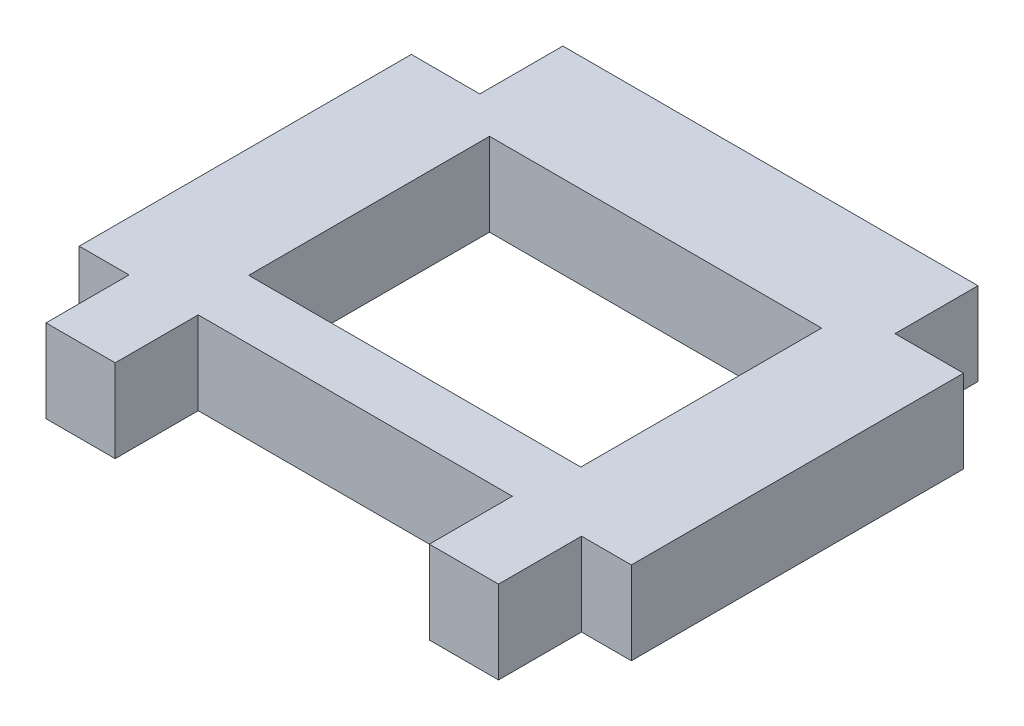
ISO-10303-21;
HEADER;
FILE_DESCRIPTION(('STEP AP214'),'2;1');
FILE_NAME('part.step','',(''),(''),'','','');
FILE_SCHEMA(('AUTOMOTIVE_DESIGN { 1 0 10303 214 1 1 1 1 }'));
ENDSEC;
DATA;
#1=APPLICATION_CONTEXT('core data for automotive mechanical design processes');
#2=APPLICATION_PROTOCOL_DEFINITION('international standard','automotive_design',2000,#1);
#3=PRODUCT_CONTEXT('',#1,'mechanical');
#4=PRODUCT('Part','Part','',(#3));
#5=PRODUCT_RELATED_PRODUCT_CATEGORY('part','',(#4));
#6=PRODUCT_DEFINITION_FORMATION('','',#4);
#7=PRODUCT_DEFINITION_CONTEXT('part definition',#1,'design');
#8=PRODUCT_DEFINITION('design','',#6,#7);
#9=PRODUCT_DEFINITION_SHAPE('','',#8);
#10=(LENGTH_UNIT() NAMED_UNIT(*) SI_UNIT(.MILLI.,.METRE.));
#11=(NAMED_UNIT(*) PLANE_ANGLE_UNIT() SI_UNIT($,.RADIAN.));
#12=(NAMED_UNIT(*) SI_UNIT($,.STERADIAN.) SOLID_ANGLE_UNIT());
#13=UNCERTAINTY_MEASURE_WITH_UNIT(LENGTH_MEASURE(1.E-05),#10,'distance_accuracy_value','');
#14=(GEOMETRIC_REPRESENTATION_CONTEXT(3) GLOBAL_UNCERTAINTY_ASSIGNED_CONTEXT((#13)) GLOBAL_UNIT_ASSIGNED_CONTEXT((#10,
#11,#12)) REPRESENTATION_CONTEXT('',''));
#15=CARTESIAN_POINT('',(0.,0.,0.));
#16=DIRECTION('',(0.,0.,1.));
#17=DIRECTION('',(1.,0.,0.));
#18=AXIS2_PLACEMENT_3D('',#15,#16,#17);
#19=CARTESIAN_POINT('',(0.,3.,0.));
#20=DIRECTION('',(0.,1.,0.));
#21=DIRECTION('',(0.,0.,1.));
#22=AXIS2_PLACEMENT_3D('',#19,#20,#21);
#23=PLANE('',#22);
#24=DIRECTION('',(0.,0.,1.));
#25=VECTOR('',#24,1.);
#26=CARTESIAN_POINT('',(12.,3.,-8.7));
#27=LINE('',#26,#25);
#28=CARTESIAN_POINT('',(12.,3.,8.7));
#29=VERTEX_POINT('',#28);
#30=CARTESIAN_POINT('',(12.,3.,-8.7));
#31=VERTEX_POINT('',#30);
#32=EDGE_CURVE('E286',#29,#31,#27,.F.);
#33=ORIENTED_EDGE('',*,*,#32,.F.);
#34=DIRECTION('',(-1.,0.,0.));
#35=VECTOR('',#34,1.);
#36=CARTESIAN_POINT('',(12.,3.,8.7));
#37=LINE('',#36,#35);
#38=CARTESIAN_POINT('',(-12.,3.,8.7));
#39=VERTEX_POINT('',#38);
#40=EDGE_CURVE('E268',#39,#29,#37,.F.);
#41=ORIENTED_EDGE('',*,*,#40,.F.);
#42=DIRECTION('',(0.,0.,-1.));
#43=VECTOR('',#42,1.);
#44=CARTESIAN_POINT('',(-12.,3.,8.7));
#45=LINE('',#44,#43);
#46=CARTESIAN_POINT('',(-12.,3.,-8.7));
#47=VERTEX_POINT('',#46);
#48=EDGE_CURVE('E271',#47,#39,#45,.F.);
#49=ORIENTED_EDGE('',*,*,#48,.F.);
#50=DIRECTION('',(1.,0.,0.));
#51=VECTOR('',#50,1.);
#52=CARTESIAN_POINT('',(-12.,3.,-8.7));
#53=LINE('',#52,#51);
#54=EDGE_CURVE('E277',#31,#47,#53,.F.);
#55=ORIENTED_EDGE('',*,*,#54,.F.);
#56=EDGE_LOOP('',(#33,#41,#49,#55));
#57=FACE_BOUND('',#56,.T.);
#58=DIRECTION('',(-1.,0.,0.));
#59=VECTOR('',#58,1.);
#60=CARTESIAN_POINT('',(19.95,3.,-11.));
#61=LINE('',#60,#59);
#62=CARTESIAN_POINT('',(15.,3.,-11.));
#63=VERTEX_POINT('',#62);
#64=CARTESIAN_POINT('',(19.95,3.,-11.));
#65=VERTEX_POINT('',#64);
#66=EDGE_CURVE('E188',#63,#65,#61,.F.);
#67=ORIENTED_EDGE('',*,*,#66,.F.);
#68=DIRECTION('',(0.,0.,-1.));
#69=VECTOR('',#68,1.);
#70=CARTESIAN_POINT('',(15.,3.,-11.));
#71=LINE('',#70,#69);
#72=CARTESIAN_POINT('',(15.,3.,-17.));
#73=VERTEX_POINT('',#72);
#74=EDGE_CURVE('E20',#73,#63,#71,.F.);
#75=ORIENTED_EDGE('',*,*,#74,.F.);
#76=DIRECTION('',(-1.,0.,0.));
#77=VECTOR('',#76,1.);
#78=CARTESIAN_POINT('',(15.,3.,-17.));
#79=LINE('',#78,#77);
#80=CARTESIAN_POINT('',(-15.,3.,-17.));
#81=VERTEX_POINT('',#80);
#82=EDGE_CURVE('E176',#81,#73,#79,.F.);
#83=ORIENTED_EDGE('',*,*,#82,.F.);
#84=DIRECTION('',(0.,0.,1.));
#85=VECTOR('',#84,1.);
#86=CARTESIAN_POINT('',(-15.,3.,-17.));
#87=LINE('',#86,#85);
#88=CARTESIAN_POINT('',(-15.,3.,-11.));
#89=VERTEX_POINT('',#88);
#90=EDGE_CURVE('E171',#89,#81,#87,.F.);
#91=ORIENTED_EDGE('',*,*,#90,.F.);
#92=DIRECTION('',(-1.,0.,0.));
#93=VECTOR('',#92,1.);
#94=CARTESIAN_POINT('',(-15.,3.,-11.));
#95=LINE('',#94,#93);
#96=CARTESIAN_POINT('',(-19.95,3.,-11.));
#97=VERTEX_POINT('',#96);
#98=EDGE_CURVE('E201',#97,#89,#95,.F.);
#99=ORIENTED_EDGE('',*,*,#98,.F.);
#100=DIRECTION('',(0.,0.,1.));
#101=VECTOR('',#100,1.);
#102=CARTESIAN_POINT('',(-19.95,3.,-11.));
#103=LINE('',#102,#101);
#104=CARTESIAN_POINT('',(-19.95,3.,13.));
#105=VERTEX_POINT('',#104);
#106=EDGE_CURVE('E207',#105,#97,#103,.F.);
#107=ORIENTED_EDGE('',*,*,#106,.F.);
#108=DIRECTION('',(1.,0.,0.));
#109=VECTOR('',#108,1.);
#110=CARTESIAN_POINT('',(-19.95,3.,13.));
#111=LINE('',#110,#109);
#112=CARTESIAN_POINT('',(-16.35,3.,13.));
#113=VERTEX_POINT('',#112);
#114=EDGE_CURVE('E213',#113,#105,#111,.F.);
#115=ORIENTED_EDGE('',*,*,#114,.F.);
#116=DIRECTION('',(0.,0.,1.));
#117=VECTOR('',#116,1.);
#118=CARTESIAN_POINT('',(-16.35,3.,13.));
#119=LINE('',#118,#117);
#120=CARTESIAN_POINT('',(-16.35,3.,19.));
#121=VERTEX_POINT('',#120);
#122=EDGE_CURVE('E219',#121,#113,#119,.F.);
#123=ORIENTED_EDGE('',*,*,#122,.F.);
#124=DIRECTION('',(1.,0.,0.));
#125=VECTOR('',#124,1.);
#126=CARTESIAN_POINT('',(-16.35,3.,19.));
#127=LINE('',#126,#125);
#128=CARTESIAN_POINT('',(-11.35,3.,19.));
#129=VERTEX_POINT('',#128);
#130=EDGE_CURVE('E225',#129,#121,#127,.F.);
#131=ORIENTED_EDGE('',*,*,#130,.F.);
#132=DIRECTION('',(0.,0.,-1.));
#133=VECTOR('',#132,1.);
#134=CARTESIAN_POINT('',(-11.35,3.,19.));
#135=LINE('',#134,#133);
#136=CARTESIAN_POINT('',(-11.35,3.,13.));
#137=VERTEX_POINT('',#136);
#138=EDGE_CURVE('E231',#137,#129,#135,.F.);
#139=ORIENTED_EDGE('',*,*,#138,.F.);
#140=DIRECTION('',(1.,0.,0.));
#141=VECTOR('',#140,1.);
#142=CARTESIAN_POINT('',(-11.35,3.,13.));
#143=LINE('',#142,#141);
#144=CARTESIAN_POINT('',(11.35,3.,13.));
#145=VERTEX_POINT('',#144);
#146=EDGE_CURVE('E237',#145,#137,#143,.F.);
#147=ORIENTED_EDGE('',*,*,#146,.F.);
#148=DIRECTION('',(0.,0.,1.));
#149=VECTOR('',#148,1.);
#150=CARTESIAN_POINT('',(11.35,3.,13.));
#151=LINE('',#150,#149);
#152=CARTESIAN_POINT('',(11.35,3.,19.));
#153=VERTEX_POINT('',#152);
#154=EDGE_CURVE('E243',#153,#145,#151,.F.);
#155=ORIENTED_EDGE('',*,*,#154,.F.);
#156=DIRECTION('',(1.,0.,0.));
#157=VECTOR('',#156,1.);
#158=CARTESIAN_POINT('',(11.35,3.,19.));
#159=LINE('',#158,#157);
#160=CARTESIAN_POINT('',(16.35,3.,19.));
#161=VERTEX_POINT('',#160);
#162=EDGE_CURVE('E247',#161,#153,#159,.F.);
#163=ORIENTED_EDGE('',*,*,#162,.F.);
#164=DIRECTION('',(0.,0.,-1.));
#165=VECTOR('',#164,1.);
#166=CARTESIAN_POINT('',(16.35,3.,19.));
#167=LINE('',#166,#165);
#168=CARTESIAN_POINT('',(16.35,3.,13.));
#169=VERTEX_POINT('',#168);
#170=EDGE_CURVE('E251',#169,#161,#167,.F.);
#171=ORIENTED_EDGE('',*,*,#170,.F.);
#172=DIRECTION('',(1.,0.,0.));
#173=VECTOR('',#172,1.);
#174=CARTESIAN_POINT('',(16.35,3.,13.));
#175=LINE('',#174,#173);
#176=CARTESIAN_POINT('',(19.95,3.,13.));
#177=VERTEX_POINT('',#176);
#178=EDGE_CURVE('E255',#177,#169,#175,.F.);
#179=ORIENTED_EDGE('',*,*,#178,.F.);
#180=DIRECTION('',(0.,0.,-1.));
#181=VECTOR('',#180,1.);
#182=CARTESIAN_POINT('',(19.95,3.,13.));
#183=LINE('',#182,#181);
#184=EDGE_CURVE('E259',#65,#177,#183,.F.);
#185=ORIENTED_EDGE('',*,*,#184,.F.);
#186=EDGE_LOOP('',(#67,#75,#83,#91,#99,#107,#115,#123,#131,#139,#147,#155,#163,#171,#179,#185));
#187=FACE_BOUND('',#186,.T.);
#188=ADVANCED_FACE('F17',(#57,#187),#23,.T.);
#189=CARTESIAN_POINT('',(15.,-3.,-11.));
#190=DIRECTION('',(1.,0.,0.));
#191=DIRECTION('',(0.,0.,-1.));
#192=AXIS2_PLACEMENT_3D('',#189,#190,#191);
#193=PLANE('',#192);
#194=DIRECTION('',(0.,1.,0.));
#195=VECTOR('',#194,1.);
#196=CARTESIAN_POINT('',(15.,-3.,-11.));
#197=LINE('',#196,#195);
#198=CARTESIAN_POINT('',(15.,-3.,-11.));
#199=VERTEX_POINT('',#198);
#200=EDGE_CURVE('E263',#199,#63,#197,.T.);
#201=ORIENTED_EDGE('',*,*,#200,.F.);
#202=DIRECTION('',(0.,0.,1.));
#203=VECTOR('',#202,1.);
#204=CARTESIAN_POINT('',(15.,-3.,0.));
#205=LINE('',#204,#203);
#206=CARTESIAN_POINT('',(15.,-3.,-17.));
#207=VERTEX_POINT('',#206);
#208=EDGE_CURVE('E194',#199,#207,#205,.F.);
#209=ORIENTED_EDGE('',*,*,#208,.T.);
#210=DIRECTION('',(0.,1.,0.));
#211=VECTOR('',#210,1.);
#212=CARTESIAN_POINT('',(15.,-3.,-17.));
#213=LINE('',#212,#211);
#214=EDGE_CURVE('E181',#73,#207,#213,.F.);
#215=ORIENTED_EDGE('',*,*,#214,.F.);
#216=ORIENTED_EDGE('',*,*,#74,.T.);
#217=EDGE_LOOP('',(#201,#209,#215,#216));
#218=FACE_BOUND('',#217,.T.);
#219=ADVANCED_FACE('F193',(#218),#193,.T.);
#220=CARTESIAN_POINT('',(15.,-3.,-17.));
#221=DIRECTION('',(0.,0.,-1.));
#222=DIRECTION('',(-1.,0.,0.));
#223=AXIS2_PLACEMENT_3D('',#220,#221,#222);
#224=PLANE('',#223);
#225=ORIENTED_EDGE('',*,*,#214,.T.);
#226=DIRECTION('',(1.,0.,0.));
#227=VECTOR('',#226,1.);
#228=CARTESIAN_POINT('',(0.,-3.,-17.));
#229=LINE('',#228,#227);
#230=CARTESIAN_POINT('',(-15.,-3.,-17.));
#231=VERTEX_POINT('',#230);
#232=EDGE_CURVE('E290',#207,#231,#229,.F.);
#233=ORIENTED_EDGE('',*,*,#232,.T.);
#234=DIRECTION('',(0.,1.,0.));
#235=VECTOR('',#234,1.);
#236=CARTESIAN_POINT('',(-15.,-3.,-17.));
#237=LINE('',#236,#235);
#238=EDGE_CURVE('E183',#81,#231,#237,.F.);
#239=ORIENTED_EDGE('',*,*,#238,.F.);
#240=ORIENTED_EDGE('',*,*,#82,.T.);
#241=EDGE_LOOP('',(#225,#233,#239,#240));
#242=FACE_BOUND('',#241,.T.);
#243=ADVANCED_FACE('F178',(#242),#224,.T.);
#244=CARTESIAN_POINT('',(-15.,-3.,-17.));
#245=DIRECTION('',(-1.,0.,0.));
#246=DIRECTION('',(0.,0.,1.));
#247=AXIS2_PLACEMENT_3D('',#244,#245,#246);
#248=PLANE('',#247);
#249=ORIENTED_EDGE('',*,*,#238,.T.);
#250=DIRECTION('',(0.,0.,1.));
#251=VECTOR('',#250,1.);
#252=CARTESIAN_POINT('',(-15.,-3.,0.));
#253=LINE('',#252,#251);
#254=CARTESIAN_POINT('',(-15.,-3.,-11.));
#255=VERTEX_POINT('',#254);
#256=EDGE_CURVE('E293',#231,#255,#253,.T.);
#257=ORIENTED_EDGE('',*,*,#256,.T.);
#258=DIRECTION('',(0.,1.,0.));
#259=VECTOR('',#258,1.);
#260=CARTESIAN_POINT('',(-15.,-3.,-11.));
#261=LINE('',#260,#259);
#262=EDGE_CURVE('E204',#89,#255,#261,.F.);
#263=ORIENTED_EDGE('',*,*,#262,.F.);
#264=ORIENTED_EDGE('',*,*,#90,.T.);
#265=EDGE_LOOP('',(#249,#257,#263,#264));
#266=FACE_BOUND('',#265,.T.);
#267=ADVANCED_FACE('F437',(#266),#248,.T.);
#268=CARTESIAN_POINT('',(-15.,-3.,-11.));
#269=DIRECTION('',(0.,0.,-1.));
#270=DIRECTION('',(-1.,0.,0.));
#271=AXIS2_PLACEMENT_3D('',#268,#269,#270);
#272=PLANE('',#271);
#273=ORIENTED_EDGE('',*,*,#262,.T.);
#274=DIRECTION('',(1.,0.,0.));
#275=VECTOR('',#274,1.);
#276=CARTESIAN_POINT('',(0.,-3.,-11.));
#277=LINE('',#276,#275);
#278=CARTESIAN_POINT('',(-19.95,-3.,-11.));
#279=VERTEX_POINT('',#278);
#280=EDGE_CURVE('E297',#255,#279,#277,.F.);
#281=ORIENTED_EDGE('',*,*,#280,.T.);
#282=DIRECTION('',(0.,1.,0.));
#283=VECTOR('',#282,1.);
#284=CARTESIAN_POINT('',(-19.95,-3.,-11.));
#285=LINE('',#284,#283);
#286=EDGE_CURVE('E210',#97,#279,#285,.F.);
#287=ORIENTED_EDGE('',*,*,#286,.F.);
#288=ORIENTED_EDGE('',*,*,#98,.T.);
#289=EDGE_LOOP('',(#273,#281,#287,#288));
#290=FACE_BOUND('',#289,.T.);
#291=ADVANCED_FACE('F433',(#290),#272,.T.);
#292=CARTESIAN_POINT('',(-19.95,-3.,-11.));
#293=DIRECTION('',(-1.,0.,0.));
#294=DIRECTION('',(0.,0.,1.));
#295=AXIS2_PLACEMENT_3D('',#292,#293,#294);
#296=PLANE('',#295);
#297=ORIENTED_EDGE('',*,*,#286,.T.);
#298=DIRECTION('',(0.,0.,1.));
#299=VECTOR('',#298,1.);
#300=CARTESIAN_POINT('',(-19.95,-3.,0.));
#301=LINE('',#300,#299);
#302=CARTESIAN_POINT('',(-19.95,-3.,13.));
#303=VERTEX_POINT('',#302);
#304=EDGE_CURVE('E301',#279,#303,#301,.T.);
#305=ORIENTED_EDGE('',*,*,#304,.T.);
#306=DIRECTION('',(0.,1.,0.));
#307=VECTOR('',#306,1.);
#308=CARTESIAN_POINT('',(-19.95,-3.,13.));
#309=LINE('',#308,#307);
#310=EDGE_CURVE('E216',#105,#303,#309,.F.);
#311=ORIENTED_EDGE('',*,*,#310,.F.);
#312=ORIENTED_EDGE('',*,*,#106,.T.);
#313=EDGE_LOOP('',(#297,#305,#311,#312));
#314=FACE_BOUND('',#313,.T.);
#315=ADVANCED_FACE('F429',(#314),#296,.T.);
#316=CARTESIAN_POINT('',(-19.95,-3.,13.));
#317=DIRECTION('',(0.,0.,1.));
#318=DIRECTION('',(1.,0.,0.));
#319=AXIS2_PLACEMENT_3D('',#316,#317,#318);
#320=PLANE('',#319);
#321=ORIENTED_EDGE('',*,*,#310,.T.);
#322=DIRECTION('',(1.,0.,0.));
#323=VECTOR('',#322,1.);
#324=CARTESIAN_POINT('',(0.,-3.,13.));
#325=LINE('',#324,#323);
#326=CARTESIAN_POINT('',(-16.35,-3.,13.));
#327=VERTEX_POINT('',#326);
#328=EDGE_CURVE('E305',#303,#327,#325,.T.);
#329=ORIENTED_EDGE('',*,*,#328,.T.);
#330=DIRECTION('',(0.,1.,0.));
#331=VECTOR('',#330,1.);
#332=CARTESIAN_POINT('',(-16.35,-3.,13.));
#333=LINE('',#332,#331);
#334=EDGE_CURVE('E222',#113,#327,#333,.F.);
#335=ORIENTED_EDGE('',*,*,#334,.F.);
#336=ORIENTED_EDGE('',*,*,#114,.T.);
#337=EDGE_LOOP('',(#321,#329,#335,#336));
#338=FACE_BOUND('',#337,.T.);
#339=ADVANCED_FACE('F425',(#338),#320,.T.);
#340=CARTESIAN_POINT('',(-16.35,-3.,13.));
#341=DIRECTION('',(-1.,0.,0.));
#342=DIRECTION('',(0.,0.,1.));
#343=AXIS2_PLACEMENT_3D('',#340,#341,#342);
#344=PLANE('',#343);
#345=ORIENTED_EDGE('',*,*,#334,.T.);
#346=DIRECTION('',(0.,0.,1.));
#347=VECTOR('',#346,1.);
#348=CARTESIAN_POINT('',(-16.35,-3.,0.));
#349=LINE('',#348,#347);
#350=CARTESIAN_POINT('',(-16.35,-3.,19.));
#351=VERTEX_POINT('',#350);
#352=EDGE_CURVE('E309',#327,#351,#349,.T.);
#353=ORIENTED_EDGE('',*,*,#352,.T.);
#354=DIRECTION('',(0.,1.,0.));
#355=VECTOR('',#354,1.);
#356=CARTESIAN_POINT('',(-16.35,-3.,19.));
#357=LINE('',#356,#355);
#358=EDGE_CURVE('E228',#121,#351,#357,.F.);
#359=ORIENTED_EDGE('',*,*,#358,.F.);
#360=ORIENTED_EDGE('',*,*,#122,.T.);
#361=EDGE_LOOP('',(#345,#353,#359,#360));
#362=FACE_BOUND('',#361,.T.);
#363=ADVANCED_FACE('F421',(#362),#344,.T.);
#364=CARTESIAN_POINT('',(-16.35,-3.,19.));
#365=DIRECTION('',(0.,0.,1.));
#366=DIRECTION('',(1.,0.,0.));
#367=AXIS2_PLACEMENT_3D('',#364,#365,#366);
#368=PLANE('',#367);
#369=ORIENTED_EDGE('',*,*,#358,.T.);
#370=DIRECTION('',(1.,0.,0.));
#371=VECTOR('',#370,1.);
#372=CARTESIAN_POINT('',(0.,-3.,19.));
#373=LINE('',#372,#371);
#374=CARTESIAN_POINT('',(-11.35,-3.,19.));
#375=VERTEX_POINT('',#374);
#376=EDGE_CURVE('E313',#351,#375,#373,.T.);
#377=ORIENTED_EDGE('',*,*,#376,.T.);
#378=DIRECTION('',(0.,1.,0.));
#379=VECTOR('',#378,1.);
#380=CARTESIAN_POINT('',(-11.35,-3.,19.));
#381=LINE('',#380,#379);
#382=EDGE_CURVE('E234',#129,#375,#381,.F.);
#383=ORIENTED_EDGE('',*,*,#382,.F.);
#384=ORIENTED_EDGE('',*,*,#130,.T.);
#385=EDGE_LOOP('',(#369,#377,#383,#384));
#386=FACE_BOUND('',#385,.T.);
#387=ADVANCED_FACE('F417',(#386),#368,.T.);
#388=CARTESIAN_POINT('',(-11.35,-3.,19.));
#389=DIRECTION('',(1.,0.,0.));
#390=DIRECTION('',(0.,0.,-1.));
#391=AXIS2_PLACEMENT_3D('',#388,#389,#390);
#392=PLANE('',#391);
#393=ORIENTED_EDGE('',*,*,#382,.T.);
#394=DIRECTION('',(0.,0.,1.));
#395=VECTOR('',#394,1.);
#396=CARTESIAN_POINT('',(-11.35,-3.,0.));
#397=LINE('',#396,#395);
#398=CARTESIAN_POINT('',(-11.35,-3.,13.));
#399=VERTEX_POINT('',#398);
#400=EDGE_CURVE('E317',#375,#399,#397,.F.);
#401=ORIENTED_EDGE('',*,*,#400,.T.);
#402=DIRECTION('',(0.,1.,0.));
#403=VECTOR('',#402,1.);
#404=CARTESIAN_POINT('',(-11.35,-3.,13.));
#405=LINE('',#404,#403);
#406=EDGE_CURVE('E240',#137,#399,#405,.F.);
#407=ORIENTED_EDGE('',*,*,#406,.F.);
#408=ORIENTED_EDGE('',*,*,#138,.T.);
#409=EDGE_LOOP('',(#393,#401,#407,#408));
#410=FACE_BOUND('',#409,.T.);
#411=ADVANCED_FACE('F413',(#410),#392,.T.);
#412=CARTESIAN_POINT('',(-11.35,-3.,13.));
#413=DIRECTION('',(0.,0.,1.));
#414=DIRECTION('',(1.,0.,0.));
#415=AXIS2_PLACEMENT_3D('',#412,#413,#414);
#416=PLANE('',#415);
#417=ORIENTED_EDGE('',*,*,#406,.T.);
#418=DIRECTION('',(1.,0.,0.));
#419=VECTOR('',#418,1.);
#420=CARTESIAN_POINT('',(0.,-3.,13.));
#421=LINE('',#420,#419);
#422=CARTESIAN_POINT('',(11.35,-3.,13.));
#423=VERTEX_POINT('',#422);
#424=EDGE_CURVE('E321',#399,#423,#421,.T.);
#425=ORIENTED_EDGE('',*,*,#424,.T.);
#426=DIRECTION('',(0.,1.,0.));
#427=VECTOR('',#426,1.);
#428=CARTESIAN_POINT('',(11.35,-3.,13.));
#429=LINE('',#428,#427);
#430=EDGE_CURVE('E245',#145,#423,#429,.F.);
#431=ORIENTED_EDGE('',*,*,#430,.F.);
#432=ORIENTED_EDGE('',*,*,#146,.T.);
#433=EDGE_LOOP('',(#417,#425,#431,#432));
#434=FACE_BOUND('',#433,.T.);
#435=ADVANCED_FACE('F409',(#434),#416,.T.);
#436=CARTESIAN_POINT('',(11.35,-3.,13.));
#437=DIRECTION('',(-1.,0.,0.));
#438=DIRECTION('',(0.,0.,1.));
#439=AXIS2_PLACEMENT_3D('',#436,#437,#438);
#440=PLANE('',#439);
#441=ORIENTED_EDGE('',*,*,#430,.T.);
#442=DIRECTION('',(0.,0.,1.));
#443=VECTOR('',#442,1.);
#444=CARTESIAN_POINT('',(11.35,-3.,0.));
#445=LINE('',#444,#443);
#446=CARTESIAN_POINT('',(11.35,-3.,19.));
#447=VERTEX_POINT('',#446);
#448=EDGE_CURVE('E325',#423,#447,#445,.T.);
#449=ORIENTED_EDGE('',*,*,#448,.T.);
#450=DIRECTION('',(0.,1.,0.));
#451=VECTOR('',#450,1.);
#452=CARTESIAN_POINT('',(11.35,-3.,19.));
#453=LINE('',#452,#451);
#454=EDGE_CURVE('E249',#153,#447,#453,.F.);
#455=ORIENTED_EDGE('',*,*,#454,.F.);
#456=ORIENTED_EDGE('',*,*,#154,.T.);
#457=EDGE_LOOP('',(#441,#449,#455,#456));
#458=FACE_BOUND('',#457,.T.);
#459=ADVANCED_FACE('F405',(#458),#440,.T.);
#460=CARTESIAN_POINT('',(11.35,-3.,19.));
#461=DIRECTION('',(0.,0.,1.));
#462=DIRECTION('',(1.,0.,0.));
#463=AXIS2_PLACEMENT_3D('',#460,#461,#462);
#464=PLANE('',#463);
#465=ORIENTED_EDGE('',*,*,#454,.T.);
#466=DIRECTION('',(1.,0.,0.));
#467=VECTOR('',#466,1.);
#468=CARTESIAN_POINT('',(0.,-3.,19.));
#469=LINE('',#468,#467);
#470=CARTESIAN_POINT('',(16.35,-3.,19.));
#471=VERTEX_POINT('',#470);
#472=EDGE_CURVE('E328',#447,#471,#469,.T.);
#473=ORIENTED_EDGE('',*,*,#472,.T.);
#474=DIRECTION('',(0.,1.,0.));
#475=VECTOR('',#474,1.);
#476=CARTESIAN_POINT('',(16.35,-3.,19.));
#477=LINE('',#476,#475);
#478=EDGE_CURVE('E253',#161,#471,#477,.F.);
#479=ORIENTED_EDGE('',*,*,#478,.F.);
#480=ORIENTED_EDGE('',*,*,#162,.T.);
#481=EDGE_LOOP('',(#465,#473,#479,#480));
#482=FACE_BOUND('',#481,.T.);
#483=ADVANCED_FACE('F401',(#482),#464,.T.);
#484=CARTESIAN_POINT('',(16.35,-3.,19.));
#485=DIRECTION('',(1.,0.,0.));
#486=DIRECTION('',(0.,0.,-1.));
#487=AXIS2_PLACEMENT_3D('',#484,#485,#486);
#488=PLANE('',#487);
#489=ORIENTED_EDGE('',*,*,#478,.T.);
#490=DIRECTION('',(0.,0.,1.));
#491=VECTOR('',#490,1.);
#492=CARTESIAN_POINT('',(16.35,-3.,0.));
#493=LINE('',#492,#491);
#494=CARTESIAN_POINT('',(16.35,-3.,13.));
#495=VERTEX_POINT('',#494);
#496=EDGE_CURVE('E331',#471,#495,#493,.F.);
#497=ORIENTED_EDGE('',*,*,#496,.T.);
#498=DIRECTION('',(0.,1.,0.));
#499=VECTOR('',#498,1.);
#500=CARTESIAN_POINT('',(16.35,-3.,13.));
#501=LINE('',#500,#499);
#502=EDGE_CURVE('E257',#169,#495,#501,.F.);
#503=ORIENTED_EDGE('',*,*,#502,.F.);
#504=ORIENTED_EDGE('',*,*,#170,.T.);
#505=EDGE_LOOP('',(#489,#497,#503,#504));
#506=FACE_BOUND('',#505,.T.);
#507=ADVANCED_FACE('F397',(#506),#488,.T.);
#508=CARTESIAN_POINT('',(16.35,-3.,13.));
#509=DIRECTION('',(0.,0.,1.));
#510=DIRECTION('',(1.,0.,0.));
#511=AXIS2_PLACEMENT_3D('',#508,#509,#510);
#512=PLANE('',#511);
#513=ORIENTED_EDGE('',*,*,#502,.T.);
#514=DIRECTION('',(1.,0.,0.));
#515=VECTOR('',#514,1.);
#516=CARTESIAN_POINT('',(0.,-3.,13.));
#517=LINE('',#516,#515);
#518=CARTESIAN_POINT('',(19.95,-3.,13.));
#519=VERTEX_POINT('',#518);
#520=EDGE_CURVE('E334',#495,#519,#517,.T.);
#521=ORIENTED_EDGE('',*,*,#520,.T.);
#522=DIRECTION('',(0.,1.,0.));
#523=VECTOR('',#522,1.);
#524=CARTESIAN_POINT('',(19.95,-3.,13.));
#525=LINE('',#524,#523);
#526=EDGE_CURVE('E261',#177,#519,#525,.F.);
#527=ORIENTED_EDGE('',*,*,#526,.F.);
#528=ORIENTED_EDGE('',*,*,#178,.T.);
#529=EDGE_LOOP('',(#513,#521,#527,#528));
#530=FACE_BOUND('',#529,.T.);
#531=ADVANCED_FACE('F393',(#530),#512,.T.);
#532=CARTESIAN_POINT('',(19.95,-3.,13.));
#533=DIRECTION('',(1.,0.,0.));
#534=DIRECTION('',(0.,0.,-1.));
#535=AXIS2_PLACEMENT_3D('',#532,#533,#534);
#536=PLANE('',#535);
#537=ORIENTED_EDGE('',*,*,#526,.T.);
#538=DIRECTION('',(0.,0.,1.));
#539=VECTOR('',#538,1.);
#540=CARTESIAN_POINT('',(19.95,-3.,0.));
#541=LINE('',#540,#539);
#542=CARTESIAN_POINT('',(19.95,-3.,-11.));
#543=VERTEX_POINT('',#542);
#544=EDGE_CURVE('E337',#519,#543,#541,.F.);
#545=ORIENTED_EDGE('',*,*,#544,.T.);
#546=DIRECTION('',(0.,1.,0.));
#547=VECTOR('',#546,1.);
#548=CARTESIAN_POINT('',(19.95,-3.,-11.));
#549=LINE('',#548,#547);
#550=EDGE_CURVE('E266',#65,#543,#549,.F.);
#551=ORIENTED_EDGE('',*,*,#550,.F.);
#552=ORIENTED_EDGE('',*,*,#184,.T.);
#553=EDGE_LOOP('',(#537,#545,#551,#552));
#554=FACE_BOUND('',#553,.T.);
#555=ADVANCED_FACE('F389',(#554),#536,.T.);
#556=CARTESIAN_POINT('',(19.95,-3.,-11.));
#557=DIRECTION('',(0.,0.,-1.));
#558=DIRECTION('',(-1.,0.,0.));
#559=AXIS2_PLACEMENT_3D('',#556,#557,#558);
#560=PLANE('',#559);
#561=ORIENTED_EDGE('',*,*,#550,.T.);
#562=DIRECTION('',(1.,0.,0.));
#563=VECTOR('',#562,1.);
#564=CARTESIAN_POINT('',(0.,-3.,-11.));
#565=LINE('',#564,#563);
#566=EDGE_CURVE('E340',#543,#199,#565,.F.);
#567=ORIENTED_EDGE('',*,*,#566,.T.);
#568=ORIENTED_EDGE('',*,*,#200,.T.);
#569=ORIENTED_EDGE('',*,*,#66,.T.);
#570=EDGE_LOOP('',(#561,#567,#568,#569));
#571=FACE_BOUND('',#570,.T.);
#572=ADVANCED_FACE('F386',(#571),#560,.T.);
#573=CARTESIAN_POINT('',(12.,-3.,8.7));
#574=DIRECTION('',(0.,0.,-1.));
#575=DIRECTION('',(-1.,0.,0.));
#576=AXIS2_PLACEMENT_3D('',#573,#574,#575);
#577=PLANE('',#576);
#578=DIRECTION('',(0.,1.,0.));
#579=VECTOR('',#578,1.);
#580=CARTESIAN_POINT('',(12.,-3.,8.7));
#581=LINE('',#580,#579);
#582=CARTESIAN_POINT('',(12.,-3.,8.7));
#583=VERTEX_POINT('',#582);
#584=EDGE_CURVE('E283',#583,#29,#581,.T.);
#585=ORIENTED_EDGE('',*,*,#584,.F.);
#586=DIRECTION('',(1.,0.,0.));
#587=VECTOR('',#586,1.);
#588=CARTESIAN_POINT('',(0.,-3.,8.7));
#589=LINE('',#588,#587);
#590=CARTESIAN_POINT('',(-12.,-3.,8.7));
#591=VERTEX_POINT('',#590);
#592=EDGE_CURVE('E343',#583,#591,#589,.F.);
#593=ORIENTED_EDGE('',*,*,#592,.T.);
#594=DIRECTION('',(0.,1.,0.));
#595=VECTOR('',#594,1.);
#596=CARTESIAN_POINT('',(-12.,-3.,8.7));
#597=LINE('',#596,#595);
#598=EDGE_CURVE('E274',#39,#591,#597,.F.);
#599=ORIENTED_EDGE('',*,*,#598,.F.);
#600=ORIENTED_EDGE('',*,*,#40,.T.);
#601=EDGE_LOOP('',(#585,#593,#599,#600));
#602=FACE_BOUND('',#601,.T.);
#603=ADVANCED_FACE('F369',(#602),#577,.T.);
#604=CARTESIAN_POINT('',(-12.,-3.,8.7));
#605=DIRECTION('',(1.,0.,0.));
#606=DIRECTION('',(0.,0.,-1.));
#607=AXIS2_PLACEMENT_3D('',#604,#605,#606);
#608=PLANE('',#607);
#609=ORIENTED_EDGE('',*,*,#598,.T.);
#610=DIRECTION('',(0.,0.,1.));
#611=VECTOR('',#610,1.);
#612=CARTESIAN_POINT('',(-12.,-3.,0.));
#613=LINE('',#612,#611);
#614=CARTESIAN_POINT('',(-12.,-3.,-8.7));
#615=VERTEX_POINT('',#614);
#616=EDGE_CURVE('E347',#591,#615,#613,.F.);
#617=ORIENTED_EDGE('',*,*,#616,.T.);
#618=DIRECTION('',(0.,1.,0.));
#619=VECTOR('',#618,1.);
#620=CARTESIAN_POINT('',(-12.,-3.,-8.7));
#621=LINE('',#620,#619);
#622=EDGE_CURVE('E280',#47,#615,#621,.F.);
#623=ORIENTED_EDGE('',*,*,#622,.F.);
#624=ORIENTED_EDGE('',*,*,#48,.T.);
#625=EDGE_LOOP('',(#609,#617,#623,#624));
#626=FACE_BOUND('',#625,.T.);
#627=ADVANCED_FACE('F363',(#626),#608,.T.);
#628=CARTESIAN_POINT('',(-12.,-3.,-8.7));
#629=DIRECTION('',(0.,0.,1.));
#630=DIRECTION('',(1.,0.,0.));
#631=AXIS2_PLACEMENT_3D('',#628,#629,#630);
#632=PLANE('',#631);
#633=ORIENTED_EDGE('',*,*,#622,.T.);
#634=DIRECTION('',(1.,0.,0.));
#635=VECTOR('',#634,1.);
#636=CARTESIAN_POINT('',(0.,-3.,-8.7));
#637=LINE('',#636,#635);
#638=CARTESIAN_POINT('',(12.,-3.,-8.7));
#639=VERTEX_POINT('',#638);
#640=EDGE_CURVE('E26',#615,#639,#637,.T.);
#641=ORIENTED_EDGE('',*,*,#640,.T.);
#642=DIRECTION('',(0.,1.,0.));
#643=VECTOR('',#642,1.);
#644=CARTESIAN_POINT('',(12.,-3.,-8.7));
#645=LINE('',#644,#643);
#646=EDGE_CURVE('E34',#31,#639,#645,.F.);
#647=ORIENTED_EDGE('',*,*,#646,.F.);
#648=ORIENTED_EDGE('',*,*,#54,.T.);
#649=EDGE_LOOP('',(#633,#641,#647,#648));
#650=FACE_BOUND('',#649,.T.);
#651=ADVANCED_FACE('F356',(#650),#632,.T.);
#652=CARTESIAN_POINT('',(12.,-3.,-8.7));
#653=DIRECTION('',(-1.,0.,0.));
#654=DIRECTION('',(0.,0.,1.));
#655=AXIS2_PLACEMENT_3D('',#652,#653,#654);
#656=PLANE('',#655);
#657=ORIENTED_EDGE('',*,*,#646,.T.);
#658=DIRECTION('',(0.,0.,1.));
#659=VECTOR('',#658,1.);
#660=CARTESIAN_POINT('',(12.,-3.,0.));
#661=LINE('',#660,#659);
#662=EDGE_CURVE('E11',#639,#583,#661,.T.);
#663=ORIENTED_EDGE('',*,*,#662,.T.);
#664=ORIENTED_EDGE('',*,*,#584,.T.);
#665=ORIENTED_EDGE('',*,*,#32,.T.);
#666=EDGE_LOOP('',(#657,#663,#664,#665));
#667=FACE_BOUND('',#666,.T.);
#668=ADVANCED_FACE('F371',(#667),#656,.T.);
#669=CARTESIAN_POINT('',(0.,-3.,0.));
#670=DIRECTION('',(0.,1.,0.));
#671=DIRECTION('',(0.,0.,1.));
#672=AXIS2_PLACEMENT_3D('',#669,#670,#671);
#673=PLANE('',#672);
#674=ORIENTED_EDGE('',*,*,#640,.F.);
#675=ORIENTED_EDGE('',*,*,#616,.F.);
#676=ORIENTED_EDGE('',*,*,#592,.F.);
#677=ORIENTED_EDGE('',*,*,#662,.F.);
#678=EDGE_LOOP('',(#674,#675,#676,#677));
#679=FACE_BOUND('',#678,.T.);
#680=ORIENTED_EDGE('',*,*,#544,.F.);
#681=ORIENTED_EDGE('',*,*,#520,.F.);
#682=ORIENTED_EDGE('',*,*,#496,.F.);
#683=ORIENTED_EDGE('',*,*,#472,.F.);
#684=ORIENTED_EDGE('',*,*,#448,.F.);
#685=ORIENTED_EDGE('',*,*,#424,.F.);
#686=ORIENTED_EDGE('',*,*,#400,.F.);
#687=ORIENTED_EDGE('',*,*,#376,.F.);
#688=ORIENTED_EDGE('',*,*,#352,.F.);
#689=ORIENTED_EDGE('',*,*,#328,.F.);
#690=ORIENTED_EDGE('',*,*,#304,.F.);
#691=ORIENTED_EDGE('',*,*,#280,.F.);
#692=ORIENTED_EDGE('',*,*,#256,.F.);
#693=ORIENTED_EDGE('',*,*,#232,.F.);
#694=ORIENTED_EDGE('',*,*,#208,.F.);
#695=ORIENTED_EDGE('',*,*,#566,.F.);
#696=EDGE_LOOP('',(#680,#681,#682,#683,#684,#685,#686,#687,#688,#689,#690,#691,#692,#693,#694,#695));
#697=FACE_BOUND('',#696,.T.);
#698=ADVANCED_FACE('F360',(#679,#697),#673,.F.);
#699=CLOSED_SHELL('',(#188,#219,#243,#267,#291,#315,#339,#363,#387,#411,#435,#459,#483,#507,
#531,#555,#572,#603,#627,#651,#668,#698));
#700=MANIFOLD_SOLID_BREP('B1',#699);
#701=ADVANCED_BREP_SHAPE_REPRESENTATION('',(#18,#700),#14);
#702=SHAPE_DEFINITION_REPRESENTATION(#9,#701);
ENDSEC;
END-ISO-10303-21;
